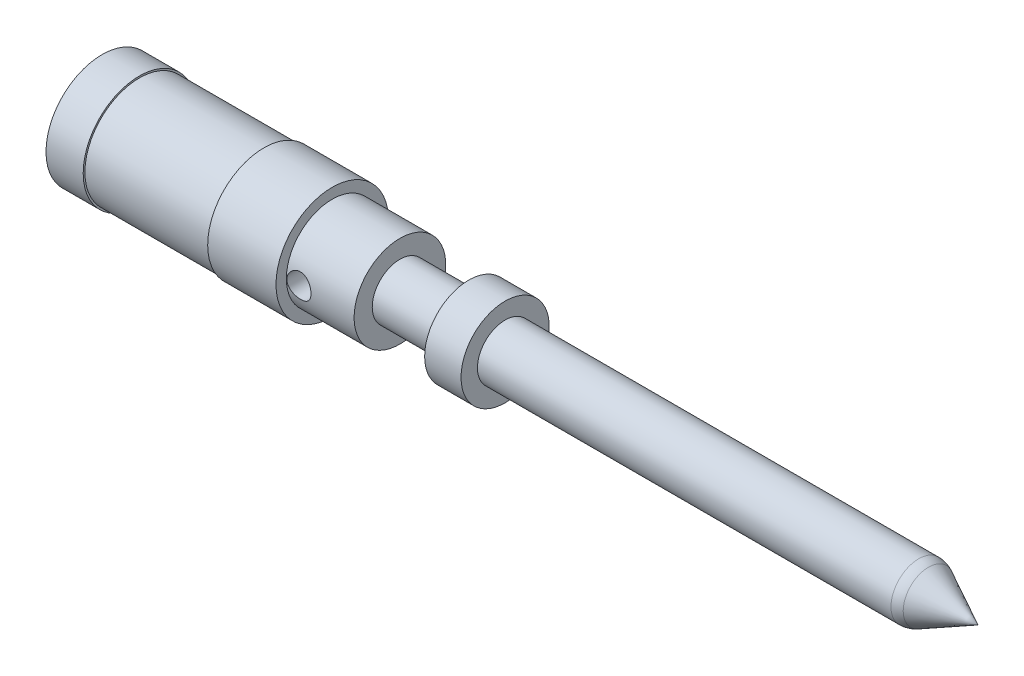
from build123d import *

# Parameters (mm, degrees)
SKETCH5_R      = 1.1303
EXTRUDE1_DEPTH = 5.9944
SKETCH6_R      = 0.354259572
EXTRUDE3_DEPTH = 5.9944
FILLET4_R      = 0.635


with BuildPart() as part:
    # Sketch1 → Revolve3 (revolve)
    with BuildSketch(Plane.XY, mode=Mode.PRIVATE) as revolve3_sk:
        Polygon((-0.734638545, 1.651), (0.357561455, 1.651), (0.357561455, 1.6002), (4.015161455, 1.6002), (4.015161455, 1.651), (6.021761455, 1.651), (6.021761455, 1.3462), (8.011006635, 1.3462), (8.011006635, 0.8128), (10.033, 0.8128), (10.033, 1.2954), (11.101761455, 1.2954), (11.101761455, 0.8128), (23.403090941, 0.8128), (24.9936, 0), (-0.734638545, 0), align=None)
    revolve(revolve3_sk.sketch.rotate(Axis((0, 0, 0), (1, 0, 0)), 90), axis=Axis((0, 0, 0), (1, 0, 0)))

    # Sketch5 → Extrude1 (cut)
    with BuildSketch(Plane.ZY.offset(0.734638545)):
        Circle(SKETCH5_R)
    extrude(amount=-EXTRUDE1_DEPTH, mode=Mode.SUBTRACT)

    # Sketch6 → Extrude3 (cut)
    with BuildSketch(Plane.XY):
        with Locations(Location((6.390841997, -0.018160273, 0), (0, 0, 177.061571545))):
            Circle(SKETCH6_R)
    extrude(amount=EXTRUDE3_DEPTH, mode=Mode.SUBTRACT)

    # Fillet4
    fillet4_edges = [part.edges().sort_by_distance(p)[0] for p in [
        (23.403090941, 0, -0.8128),
    ]]
    fillet(fillet4_edges, radius=FILLET4_R)


solid = part.part
